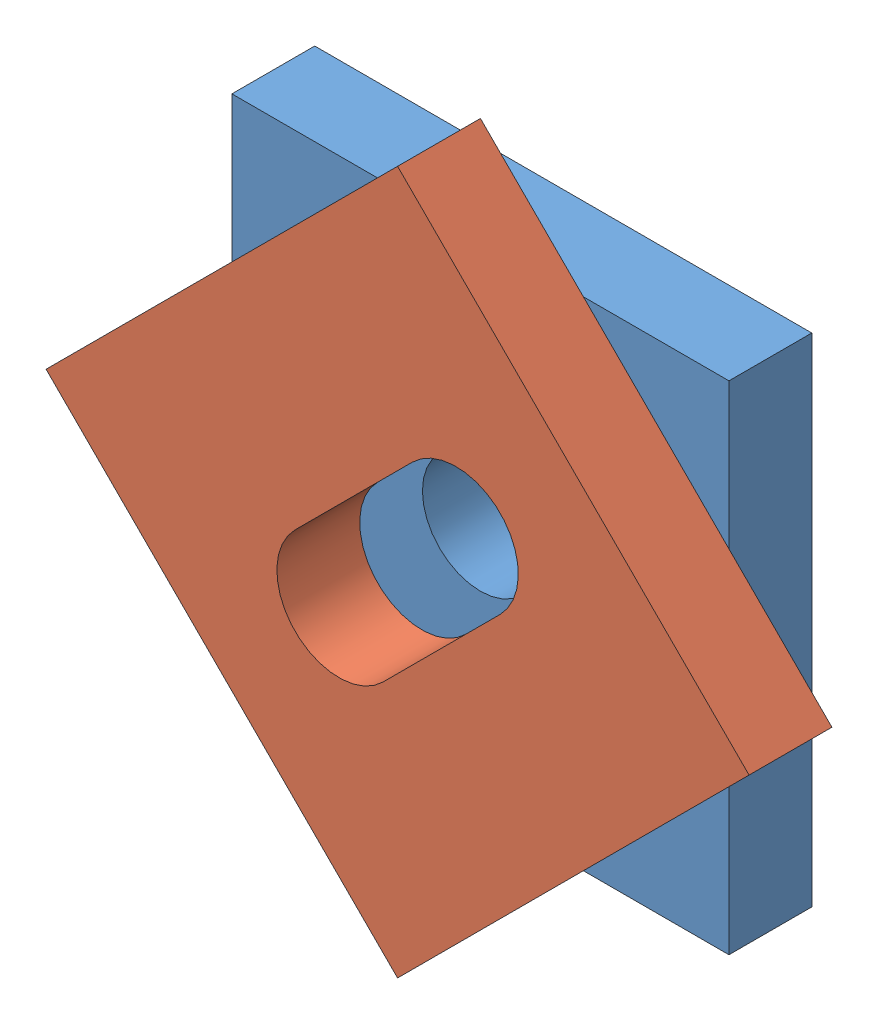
SolidWorks assembly Baugruppe1.sldasm, configuration Standard (file format 4400). Lengths in mm.
Overall size (84.85 84.85 20).
2 component instances, 2 part files, 3 mates.
Components (placement in the parent):
- Blech RL-1: Blech RL.SLDPRT [Standard] at origin size (60 60 10)
- Blech LL-1: Blech LL.SLDPRT [Standard] at (30 -12.4264 10) x (0.707107 0.707107 0) z (0 0 1) size (60 60 10)
Mates (geometry in assembly coordinates):
- Deckungsgleich1: coincident anti-aligned: plane of Blech RL-1 through (0 60 10) normal (0 0 1); plane of Blech LL-1 through (0 60 10) normal (0 0 -1)
- Deckungsgleich2: coincident aligned: axis of Blech RL-1 through (30 30 0) axis (0 0 1); axis of Blech LL-1 through (30 30 10) axis (0 0 1)
- Winkel1: planar angle = 0.785398 rad aligned: plane of assembly; plane of Blech LL-1
